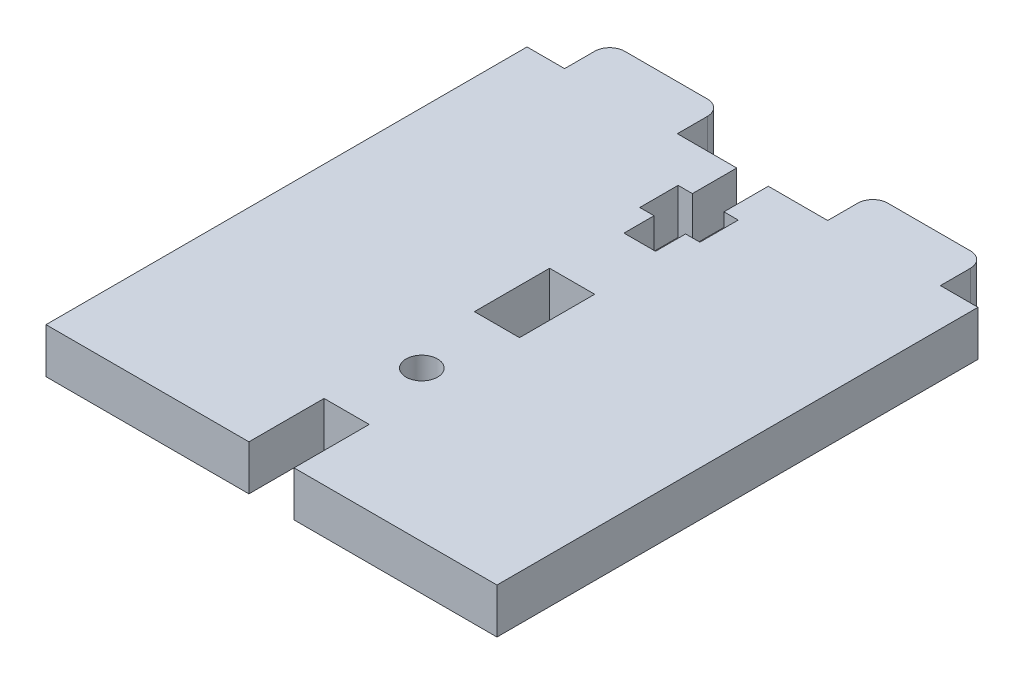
ISO-10303-21;
HEADER;
FILE_DESCRIPTION(('STEP AP214'),'2;1');
FILE_NAME('part.step','',(''),(''),'','','');
FILE_SCHEMA(('AUTOMOTIVE_DESIGN { 1 0 10303 214 1 1 1 1 }'));
ENDSEC;
DATA;
#1=APPLICATION_CONTEXT('core data for automotive mechanical design processes');
#2=APPLICATION_PROTOCOL_DEFINITION('international standard','automotive_design',2000,#1);
#3=PRODUCT_CONTEXT('',#1,'mechanical');
#4=PRODUCT('Part','Part','',(#3));
#5=PRODUCT_RELATED_PRODUCT_CATEGORY('part','',(#4));
#6=PRODUCT_DEFINITION_FORMATION('','',#4);
#7=PRODUCT_DEFINITION_CONTEXT('part definition',#1,'design');
#8=PRODUCT_DEFINITION('design','',#6,#7);
#9=PRODUCT_DEFINITION_SHAPE('','',#8);
#10=(LENGTH_UNIT() NAMED_UNIT(*) SI_UNIT(.MILLI.,.METRE.));
#11=(NAMED_UNIT(*) PLANE_ANGLE_UNIT() SI_UNIT($,.RADIAN.));
#12=(NAMED_UNIT(*) SI_UNIT($,.STERADIAN.) SOLID_ANGLE_UNIT());
#13=UNCERTAINTY_MEASURE_WITH_UNIT(LENGTH_MEASURE(1.E-05),#10,'distance_accuracy_value','');
#14=(GEOMETRIC_REPRESENTATION_CONTEXT(3) GLOBAL_UNCERTAINTY_ASSIGNED_CONTEXT((#13)) GLOBAL_UNIT_ASSIGNED_CONTEXT((#10,
#11,#12)) REPRESENTATION_CONTEXT('',''));
#15=CARTESIAN_POINT('',(0.,0.,0.));
#16=DIRECTION('',(0.,0.,1.));
#17=DIRECTION('',(1.,0.,0.));
#18=AXIS2_PLACEMENT_3D('',#15,#16,#17);
#19=CARTESIAN_POINT('',(0.,6.,24.));
#20=DIRECTION('',(0.,0.,-1.));
#21=DIRECTION('',(-1.,0.,0.));
#22=AXIS2_PLACEMENT_3D('',#19,#20,#21);
#23=PLANE('',#22);
#24=DIRECTION('',(1.,0.,0.));
#25=VECTOR('',#24,1.);
#26=CARTESIAN_POINT('',(0.,0.,24.));
#27=LINE('',#26,#25);
#28=CARTESIAN_POINT('',(27.,0.,24.));
#29=VERTEX_POINT('',#28);
#30=CARTESIAN_POINT('',(33.,0.,24.));
#31=VERTEX_POINT('',#30);
#32=EDGE_CURVE('E379',#29,#31,#27,.T.);
#33=ORIENTED_EDGE('',*,*,#32,.T.);
#34=DIRECTION('',(0.,-1.,0.));
#35=VECTOR('',#34,1.);
#36=CARTESIAN_POINT('',(33.,6.,24.));
#37=LINE('',#36,#35);
#38=CARTESIAN_POINT('',(33.,6.,24.));
#39=VERTEX_POINT('',#38);
#40=EDGE_CURVE('E11',#39,#31,#37,.T.);
#41=ORIENTED_EDGE('',*,*,#40,.F.);
#42=DIRECTION('',(1.,0.,0.));
#43=VECTOR('',#42,1.);
#44=CARTESIAN_POINT('',(0.,6.,24.));
#45=LINE('',#44,#43);
#46=CARTESIAN_POINT('',(27.,6.,24.));
#47=VERTEX_POINT('',#46);
#48=EDGE_CURVE('E284',#47,#39,#45,.T.);
#49=ORIENTED_EDGE('',*,*,#48,.F.);
#50=DIRECTION('',(0.,-1.,0.));
#51=VECTOR('',#50,1.);
#52=CARTESIAN_POINT('',(27.,6.,24.));
#53=LINE('',#52,#51);
#54=EDGE_CURVE('E56',#47,#29,#53,.T.);
#55=ORIENTED_EDGE('',*,*,#54,.T.);
#56=EDGE_LOOP('',(#33,#41,#49,#55));
#57=FACE_BOUND('',#56,.T.);
#58=ADVANCED_FACE('F37',(#57),#23,.F.);
#59=CARTESIAN_POINT('',(33.,6.,0.));
#60=DIRECTION('',(1.,0.,0.));
#61=DIRECTION('',(0.,0.,-1.));
#62=AXIS2_PLACEMENT_3D('',#59,#60,#61);
#63=PLANE('',#62);
#64=DIRECTION('',(0.,0.,1.));
#65=VECTOR('',#64,1.);
#66=CARTESIAN_POINT('',(33.,0.,0.));
#67=LINE('',#66,#65);
#68=CARTESIAN_POINT('',(33.,0.,34.));
#69=VERTEX_POINT('',#68);
#70=EDGE_CURVE('E290',#31,#69,#67,.T.);
#71=ORIENTED_EDGE('',*,*,#70,.T.);
#72=DIRECTION('',(0.,-1.,0.));
#73=VECTOR('',#72,1.);
#74=CARTESIAN_POINT('',(33.,6.,34.));
#75=LINE('',#74,#73);
#76=CARTESIAN_POINT('',(33.,6.,34.));
#77=VERTEX_POINT('',#76);
#78=EDGE_CURVE('E47',#77,#69,#75,.T.);
#79=ORIENTED_EDGE('',*,*,#78,.F.);
#80=DIRECTION('',(0.,0.,1.));
#81=VECTOR('',#80,1.);
#82=CARTESIAN_POINT('',(33.,6.,0.));
#83=LINE('',#82,#81);
#84=EDGE_CURVE('E278',#39,#77,#83,.T.);
#85=ORIENTED_EDGE('',*,*,#84,.F.);
#86=ORIENTED_EDGE('',*,*,#40,.T.);
#87=EDGE_LOOP('',(#71,#79,#85,#86));
#88=FACE_BOUND('',#87,.T.);
#89=ADVANCED_FACE('F289',(#88),#63,.F.);
#90=CARTESIAN_POINT('',(0.,6.,34.));
#91=DIRECTION('',(0.,0.,-1.));
#92=DIRECTION('',(-1.,0.,0.));
#93=AXIS2_PLACEMENT_3D('',#90,#91,#92);
#94=PLANE('',#93);
#95=DIRECTION('',(1.,0.,0.));
#96=VECTOR('',#95,1.);
#97=CARTESIAN_POINT('',(0.,0.,34.));
#98=LINE('',#97,#96);
#99=CARTESIAN_POINT('',(27.,0.,34.));
#100=VERTEX_POINT('',#99);
#101=EDGE_CURVE('E382',#100,#69,#98,.T.);
#102=ORIENTED_EDGE('',*,*,#101,.F.);
#103=DIRECTION('',(0.,-1.,0.));
#104=VECTOR('',#103,1.);
#105=CARTESIAN_POINT('',(27.,6.,34.));
#106=LINE('',#105,#104);
#107=CARTESIAN_POINT('',(27.,6.,34.));
#108=VERTEX_POINT('',#107);
#109=EDGE_CURVE('E166',#108,#100,#106,.T.);
#110=ORIENTED_EDGE('',*,*,#109,.F.);
#111=DIRECTION('',(1.,0.,0.));
#112=VECTOR('',#111,1.);
#113=CARTESIAN_POINT('',(0.,6.,34.));
#114=LINE('',#113,#112);
#115=EDGE_CURVE('E283',#108,#77,#114,.T.);
#116=ORIENTED_EDGE('',*,*,#115,.T.);
#117=ORIENTED_EDGE('',*,*,#78,.T.);
#118=EDGE_LOOP('',(#102,#110,#116,#117));
#119=FACE_BOUND('',#118,.T.);
#120=ADVANCED_FACE('F294',(#119),#94,.T.);
#121=CARTESIAN_POINT('',(7.,6.,-4.));
#122=DIRECTION('',(0.,-1.,0.));
#123=DIRECTION('',(0.,0.,-1.));
#124=AXIS2_PLACEMENT_3D('',#121,#122,#123);
#125=CYLINDRICAL_SURFACE('',#124,2.);
#126=CARTESIAN_POINT('',(7.,0.,-4.));
#127=DIRECTION('',(0.,1.,0.));
#128=DIRECTION('',(0.,0.,1.));
#129=AXIS2_PLACEMENT_3D('',#126,#127,#128);
#130=CIRCLE('',#129,2.);
#131=CARTESIAN_POINT('',(5.,0.,-3.99999999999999));
#132=VERTEX_POINT('',#131);
#133=CARTESIAN_POINT('',(7.00000000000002,0.,-6.));
#134=VERTEX_POINT('',#133);
#135=EDGE_CURVE('E301',#132,#134,#130,.F.);
#136=ORIENTED_EDGE('',*,*,#135,.F.);
#137=DIRECTION('',(0.,-1.,0.));
#138=VECTOR('',#137,1.);
#139=CARTESIAN_POINT('',(5.,6.,-3.99999999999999));
#140=LINE('',#139,#138);
#141=CARTESIAN_POINT('',(5.,6.,-3.99999999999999));
#142=VERTEX_POINT('',#141);
#143=EDGE_CURVE('E41',#142,#132,#140,.T.);
#144=ORIENTED_EDGE('',*,*,#143,.F.);
#145=CARTESIAN_POINT('',(7.,6.,-4.));
#146=DIRECTION('',(0.,1.,0.));
#147=DIRECTION('',(0.,0.,1.));
#148=AXIS2_PLACEMENT_3D('',#145,#146,#147);
#149=CIRCLE('',#148,2.);
#150=CARTESIAN_POINT('',(7.00000000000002,6.,-6.));
#151=VERTEX_POINT('',#150);
#152=EDGE_CURVE('E387',#142,#151,#149,.F.);
#153=ORIENTED_EDGE('',*,*,#152,.T.);
#154=DIRECTION('',(0.,-1.,0.));
#155=VECTOR('',#154,1.);
#156=CARTESIAN_POINT('',(7.00000000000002,6.,-6.));
#157=LINE('',#156,#155);
#158=EDGE_CURVE('E297',#151,#134,#157,.T.);
#159=ORIENTED_EDGE('',*,*,#158,.T.);
#160=EDGE_LOOP('',(#136,#144,#153,#159));
#161=FACE_BOUND('',#160,.T.);
#162=ADVANCED_FACE('F39',(#161),#125,.T.);
#163=CARTESIAN_POINT('',(5.,6.,0.));
#164=DIRECTION('',(-1.,0.,0.));
#165=DIRECTION('',(0.,0.,1.));
#166=AXIS2_PLACEMENT_3D('',#163,#164,#165);
#167=PLANE('',#166);
#168=DIRECTION('',(0.,0.,-1.));
#169=VECTOR('',#168,1.);
#170=CARTESIAN_POINT('',(5.,0.,0.));
#171=LINE('',#170,#169);
#172=CARTESIAN_POINT('',(5.,0.,0.));
#173=VERTEX_POINT('',#172);
#174=EDGE_CURVE('E304',#173,#132,#171,.T.);
#175=ORIENTED_EDGE('',*,*,#174,.F.);
#176=DIRECTION('',(0.,-1.,0.));
#177=VECTOR('',#176,1.);
#178=CARTESIAN_POINT('',(5.,6.,0.));
#179=LINE('',#178,#177);
#180=CARTESIAN_POINT('',(5.,6.,0.));
#181=VERTEX_POINT('',#180);
#182=EDGE_CURVE('E453',#181,#173,#179,.T.);
#183=ORIENTED_EDGE('',*,*,#182,.F.);
#184=DIRECTION('',(0.,0.,-1.));
#185=VECTOR('',#184,1.);
#186=CARTESIAN_POINT('',(5.,6.,0.));
#187=LINE('',#186,#185);
#188=EDGE_CURVE('E462',#181,#142,#187,.T.);
#189=ORIENTED_EDGE('',*,*,#188,.T.);
#190=ORIENTED_EDGE('',*,*,#143,.T.);
#191=EDGE_LOOP('',(#175,#183,#189,#190));
#192=FACE_BOUND('',#191,.T.);
#193=ADVANCED_FACE('F460',(#192),#167,.T.);
#194=CARTESIAN_POINT('',(0.,6.,0.));
#195=DIRECTION('',(0.,0.,-1.));
#196=DIRECTION('',(-1.,0.,0.));
#197=AXIS2_PLACEMENT_3D('',#194,#195,#196);
#198=PLANE('',#197);
#199=DIRECTION('',(1.,0.,0.));
#200=VECTOR('',#199,1.);
#201=CARTESIAN_POINT('',(0.,0.,0.));
#202=LINE('',#201,#200);
#203=CARTESIAN_POINT('',(0.,0.,0.));
#204=VERTEX_POINT('',#203);
#205=EDGE_CURVE('E307',#204,#173,#202,.T.);
#206=ORIENTED_EDGE('',*,*,#205,.F.);
#207=DIRECTION('',(0.,-1.,0.));
#208=VECTOR('',#207,1.);
#209=CARTESIAN_POINT('',(0.,6.,0.));
#210=LINE('',#209,#208);
#211=CARTESIAN_POINT('',(0.,6.,0.));
#212=VERTEX_POINT('',#211);
#213=EDGE_CURVE('E452',#212,#204,#210,.T.);
#214=ORIENTED_EDGE('',*,*,#213,.F.);
#215=DIRECTION('',(1.,0.,0.));
#216=VECTOR('',#215,1.);
#217=CARTESIAN_POINT('',(0.,6.,0.));
#218=LINE('',#217,#216);
#219=EDGE_CURVE('E472',#212,#181,#218,.T.);
#220=ORIENTED_EDGE('',*,*,#219,.T.);
#221=ORIENTED_EDGE('',*,*,#182,.T.);
#222=EDGE_LOOP('',(#206,#214,#220,#221));
#223=FACE_BOUND('',#222,.T.);
#224=ADVANCED_FACE('F469',(#223),#198,.T.);
#225=CARTESIAN_POINT('',(0.,6.,0.));
#226=DIRECTION('',(1.,0.,0.));
#227=DIRECTION('',(0.,0.,-1.));
#228=AXIS2_PLACEMENT_3D('',#225,#226,#227);
#229=PLANE('',#228);
#230=DIRECTION('',(0.,0.,1.));
#231=VECTOR('',#230,1.);
#232=CARTESIAN_POINT('',(0.,0.,0.));
#233=LINE('',#232,#231);
#234=CARTESIAN_POINT('',(0.,0.,64.));
#235=VERTEX_POINT('',#234);
#236=EDGE_CURVE('E310',#204,#235,#233,.T.);
#237=ORIENTED_EDGE('',*,*,#236,.T.);
#238=DIRECTION('',(0.,-1.,0.));
#239=VECTOR('',#238,1.);
#240=CARTESIAN_POINT('',(0.,6.,64.));
#241=LINE('',#240,#239);
#242=CARTESIAN_POINT('',(0.,6.,64.));
#243=VERTEX_POINT('',#242);
#244=EDGE_CURVE('E449',#243,#235,#241,.T.);
#245=ORIENTED_EDGE('',*,*,#244,.F.);
#246=DIRECTION('',(0.,0.,1.));
#247=VECTOR('',#246,1.);
#248=CARTESIAN_POINT('',(0.,6.,0.));
#249=LINE('',#248,#247);
#250=EDGE_CURVE('E475',#212,#243,#249,.T.);
#251=ORIENTED_EDGE('',*,*,#250,.F.);
#252=ORIENTED_EDGE('',*,*,#213,.T.);
#253=EDGE_LOOP('',(#237,#245,#251,#252));
#254=FACE_BOUND('',#253,.T.);
#255=ADVANCED_FACE('F476',(#254),#229,.F.);
#256=CARTESIAN_POINT('',(0.,6.,64.));
#257=DIRECTION('',(0.,0.,-1.));
#258=DIRECTION('',(-1.,0.,0.));
#259=AXIS2_PLACEMENT_3D('',#256,#257,#258);
#260=PLANE('',#259);
#261=DIRECTION('',(1.,0.,0.));
#262=VECTOR('',#261,1.);
#263=CARTESIAN_POINT('',(0.,0.,64.));
#264=LINE('',#263,#262);
#265=CARTESIAN_POINT('',(27.,0.,64.));
#266=VERTEX_POINT('',#265);
#267=EDGE_CURVE('E314',#235,#266,#264,.T.);
#268=ORIENTED_EDGE('',*,*,#267,.T.);
#269=DIRECTION('',(0.,-1.,0.));
#270=VECTOR('',#269,1.);
#271=CARTESIAN_POINT('',(27.,6.,64.));
#272=LINE('',#271,#270);
#273=CARTESIAN_POINT('',(27.,6.,64.));
#274=VERTEX_POINT('',#273);
#275=EDGE_CURVE('E447',#274,#266,#272,.T.);
#276=ORIENTED_EDGE('',*,*,#275,.F.);
#277=DIRECTION('',(1.,0.,0.));
#278=VECTOR('',#277,1.);
#279=CARTESIAN_POINT('',(0.,6.,64.));
#280=LINE('',#279,#278);
#281=EDGE_CURVE('E479',#243,#274,#280,.T.);
#282=ORIENTED_EDGE('',*,*,#281,.F.);
#283=ORIENTED_EDGE('',*,*,#244,.T.);
#284=EDGE_LOOP('',(#268,#276,#282,#283));
#285=FACE_BOUND('',#284,.T.);
#286=ADVANCED_FACE('F645',(#285),#260,.F.);
#287=CARTESIAN_POINT('',(27.,6.,0.));
#288=DIRECTION('',(1.,0.,0.));
#289=DIRECTION('',(0.,0.,-1.));
#290=AXIS2_PLACEMENT_3D('',#287,#288,#289);
#291=PLANE('',#290);
#292=DIRECTION('',(0.,0.,1.));
#293=VECTOR('',#292,1.);
#294=CARTESIAN_POINT('',(27.,0.,0.));
#295=LINE('',#294,#293);
#296=CARTESIAN_POINT('',(27.,0.,54.));
#297=VERTEX_POINT('',#296);
#298=EDGE_CURVE('E317',#297,#266,#295,.T.);
#299=ORIENTED_EDGE('',*,*,#298,.F.);
#300=DIRECTION('',(0.,-1.,0.));
#301=VECTOR('',#300,1.);
#302=CARTESIAN_POINT('',(27.,6.,54.));
#303=LINE('',#302,#301);
#304=CARTESIAN_POINT('',(27.,6.,54.));
#305=VERTEX_POINT('',#304);
#306=EDGE_CURVE('E445',#305,#297,#303,.T.);
#307=ORIENTED_EDGE('',*,*,#306,.F.);
#308=DIRECTION('',(0.,0.,1.));
#309=VECTOR('',#308,1.);
#310=CARTESIAN_POINT('',(27.,6.,0.));
#311=LINE('',#310,#309);
#312=EDGE_CURVE('E980',#305,#274,#311,.T.);
#313=ORIENTED_EDGE('',*,*,#312,.T.);
#314=ORIENTED_EDGE('',*,*,#275,.T.);
#315=EDGE_LOOP('',(#299,#307,#313,#314));
#316=FACE_BOUND('',#315,.T.);
#317=ADVANCED_FACE('F652',(#316),#291,.T.);
#318=CARTESIAN_POINT('',(0.,6.,54.));
#319=DIRECTION('',(0.,0.,-1.));
#320=DIRECTION('',(-1.,0.,0.));
#321=AXIS2_PLACEMENT_3D('',#318,#319,#320);
#322=PLANE('',#321);
#323=DIRECTION('',(1.,0.,0.));
#324=VECTOR('',#323,1.);
#325=CARTESIAN_POINT('',(0.,0.,54.));
#326=LINE('',#325,#324);
#327=CARTESIAN_POINT('',(33.,0.,54.));
#328=VERTEX_POINT('',#327);
#329=EDGE_CURVE('E321',#297,#328,#326,.T.);
#330=ORIENTED_EDGE('',*,*,#329,.T.);
#331=DIRECTION('',(0.,-1.,0.));
#332=VECTOR('',#331,1.);
#333=CARTESIAN_POINT('',(33.,6.,54.));
#334=LINE('',#333,#332);
#335=CARTESIAN_POINT('',(33.,6.,54.));
#336=VERTEX_POINT('',#335);
#337=EDGE_CURVE('E442',#336,#328,#334,.T.);
#338=ORIENTED_EDGE('',*,*,#337,.F.);
#339=DIRECTION('',(1.,0.,0.));
#340=VECTOR('',#339,1.);
#341=CARTESIAN_POINT('',(0.,6.,54.));
#342=LINE('',#341,#340);
#343=EDGE_CURVE('E977',#305,#336,#342,.T.);
#344=ORIENTED_EDGE('',*,*,#343,.F.);
#345=ORIENTED_EDGE('',*,*,#306,.T.);
#346=EDGE_LOOP('',(#330,#338,#344,#345));
#347=FACE_BOUND('',#346,.T.);
#348=ADVANCED_FACE('F648',(#347),#322,.F.);
#349=CARTESIAN_POINT('',(33.,6.,0.));
#350=DIRECTION('',(1.,0.,0.));
#351=DIRECTION('',(0.,0.,-1.));
#352=AXIS2_PLACEMENT_3D('',#349,#350,#351);
#353=PLANE('',#352);
#354=DIRECTION('',(0.,0.,1.));
#355=VECTOR('',#354,1.);
#356=CARTESIAN_POINT('',(33.,0.,0.));
#357=LINE('',#356,#355);
#358=CARTESIAN_POINT('',(33.,0.,64.));
#359=VERTEX_POINT('',#358);
#360=EDGE_CURVE('E323',#328,#359,#357,.T.);
#361=ORIENTED_EDGE('',*,*,#360,.T.);
#362=DIRECTION('',(0.,-1.,0.));
#363=VECTOR('',#362,1.);
#364=CARTESIAN_POINT('',(33.,6.,64.));
#365=LINE('',#364,#363);
#366=CARTESIAN_POINT('',(33.,6.,64.));
#367=VERTEX_POINT('',#366);
#368=EDGE_CURVE('E439',#367,#359,#365,.T.);
#369=ORIENTED_EDGE('',*,*,#368,.F.);
#370=DIRECTION('',(0.,0.,1.));
#371=VECTOR('',#370,1.);
#372=CARTESIAN_POINT('',(33.,6.,0.));
#373=LINE('',#372,#371);
#374=EDGE_CURVE('E975',#336,#367,#373,.T.);
#375=ORIENTED_EDGE('',*,*,#374,.F.);
#376=ORIENTED_EDGE('',*,*,#337,.T.);
#377=EDGE_LOOP('',(#361,#369,#375,#376));
#378=FACE_BOUND('',#377,.T.);
#379=ADVANCED_FACE('F643',(#378),#353,.F.);
#380=CARTESIAN_POINT('',(60.,0.,64.));
#381=VERTEX_POINT('',#380);
#382=EDGE_CURVE('E318',#359,#381,#264,.T.);
#383=ORIENTED_EDGE('',*,*,#382,.T.);
#384=DIRECTION('',(0.,-1.,0.));
#385=VECTOR('',#384,1.);
#386=CARTESIAN_POINT('',(60.,6.,64.));
#387=LINE('',#386,#385);
#388=CARTESIAN_POINT('',(60.,6.,64.));
#389=VERTEX_POINT('',#388);
#390=EDGE_CURVE('E437',#389,#381,#387,.T.);
#391=ORIENTED_EDGE('',*,*,#390,.F.);
#392=EDGE_CURVE('E498',#367,#389,#280,.T.);
#393=ORIENTED_EDGE('',*,*,#392,.F.);
#394=ORIENTED_EDGE('',*,*,#368,.T.);
#395=EDGE_LOOP('',(#383,#391,#393,#394));
#396=FACE_BOUND('',#395,.T.);
#397=ADVANCED_FACE('F639',(#396),#260,.F.);
#398=CARTESIAN_POINT('',(60.,6.,0.));
#399=DIRECTION('',(1.,0.,0.));
#400=DIRECTION('',(0.,0.,-1.));
#401=AXIS2_PLACEMENT_3D('',#398,#399,#400);
#402=PLANE('',#401);
#403=DIRECTION('',(0.,0.,1.));
#404=VECTOR('',#403,1.);
#405=CARTESIAN_POINT('',(60.,0.,0.));
#406=LINE('',#405,#404);
#407=CARTESIAN_POINT('',(60.,0.,0.));
#408=VERTEX_POINT('',#407);
#409=EDGE_CURVE('E325',#408,#381,#406,.T.);
#410=ORIENTED_EDGE('',*,*,#409,.F.);
#411=DIRECTION('',(0.,-1.,0.));
#412=VECTOR('',#411,1.);
#413=CARTESIAN_POINT('',(60.,6.,0.));
#414=LINE('',#413,#412);
#415=CARTESIAN_POINT('',(60.,6.,0.));
#416=VERTEX_POINT('',#415);
#417=EDGE_CURVE('E435',#416,#408,#414,.T.);
#418=ORIENTED_EDGE('',*,*,#417,.F.);
#419=DIRECTION('',(0.,0.,1.));
#420=VECTOR('',#419,1.);
#421=CARTESIAN_POINT('',(60.,6.,0.));
#422=LINE('',#421,#420);
#423=EDGE_CURVE('E492',#416,#389,#422,.T.);
#424=ORIENTED_EDGE('',*,*,#423,.T.);
#425=ORIENTED_EDGE('',*,*,#390,.T.);
#426=EDGE_LOOP('',(#410,#418,#424,#425));
#427=FACE_BOUND('',#426,.T.);
#428=ADVANCED_FACE('F636',(#427),#402,.T.);
#429=CARTESIAN_POINT('',(55.,0.,0.));
#430=VERTEX_POINT('',#429);
#431=EDGE_CURVE('E312',#430,#408,#202,.T.);
#432=ORIENTED_EDGE('',*,*,#431,.F.);
#433=DIRECTION('',(0.,-1.,0.));
#434=VECTOR('',#433,1.);
#435=CARTESIAN_POINT('',(55.,6.,0.));
#436=LINE('',#435,#434);
#437=CARTESIAN_POINT('',(55.,6.,0.));
#438=VERTEX_POINT('',#437);
#439=EDGE_CURVE('E433',#438,#430,#436,.T.);
#440=ORIENTED_EDGE('',*,*,#439,.F.);
#441=EDGE_CURVE('E484',#438,#416,#218,.T.);
#442=ORIENTED_EDGE('',*,*,#441,.T.);
#443=ORIENTED_EDGE('',*,*,#417,.T.);
#444=EDGE_LOOP('',(#432,#440,#442,#443));
#445=FACE_BOUND('',#444,.T.);
#446=ADVANCED_FACE('F634',(#445),#198,.T.);
#447=CARTESIAN_POINT('',(55.,6.,0.));
#448=DIRECTION('',(-1.,0.,0.));
#449=DIRECTION('',(0.,0.,1.));
#450=AXIS2_PLACEMENT_3D('',#447,#448,#449);
#451=PLANE('',#450);
#452=DIRECTION('',(0.,0.,-1.));
#453=VECTOR('',#452,1.);
#454=CARTESIAN_POINT('',(55.,0.,0.));
#455=LINE('',#454,#453);
#456=CARTESIAN_POINT('',(55.,0.,-3.99999999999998));
#457=VERTEX_POINT('',#456);
#458=EDGE_CURVE('E328',#430,#457,#455,.T.);
#459=ORIENTED_EDGE('',*,*,#458,.T.);
#460=DIRECTION('',(0.,-1.,0.));
#461=VECTOR('',#460,1.);
#462=CARTESIAN_POINT('',(55.,6.,-3.99999999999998));
#463=LINE('',#462,#461);
#464=CARTESIAN_POINT('',(55.,6.,-3.99999999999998));
#465=VERTEX_POINT('',#464);
#466=EDGE_CURVE('E431',#465,#457,#463,.T.);
#467=ORIENTED_EDGE('',*,*,#466,.F.);
#468=DIRECTION('',(0.,0.,-1.));
#469=VECTOR('',#468,1.);
#470=CARTESIAN_POINT('',(55.,6.,0.));
#471=LINE('',#470,#469);
#472=EDGE_CURVE('E491',#438,#465,#471,.T.);
#473=ORIENTED_EDGE('',*,*,#472,.F.);
#474=ORIENTED_EDGE('',*,*,#439,.T.);
#475=EDGE_LOOP('',(#459,#467,#473,#474));
#476=FACE_BOUND('',#475,.T.);
#477=ADVANCED_FACE('F630',(#476),#451,.F.);
#478=CARTESIAN_POINT('',(53.,6.,-4.));
#479=DIRECTION('',(0.,-1.,0.));
#480=DIRECTION('',(0.,0.,-1.));
#481=AXIS2_PLACEMENT_3D('',#478,#479,#480);
#482=CYLINDRICAL_SURFACE('',#481,2.);
#483=CARTESIAN_POINT('',(53.,0.,-4.));
#484=DIRECTION('',(0.,1.,0.));
#485=DIRECTION('',(0.,0.,1.));
#486=AXIS2_PLACEMENT_3D('',#483,#484,#485);
#487=CIRCLE('',#486,2.);
#488=CARTESIAN_POINT('',(53.,0.,-6.));
#489=VERTEX_POINT('',#488);
#490=EDGE_CURVE('E331',#489,#457,#487,.F.);
#491=ORIENTED_EDGE('',*,*,#490,.F.);
#492=DIRECTION('',(0.,-1.,0.));
#493=VECTOR('',#492,1.);
#494=CARTESIAN_POINT('',(53.,6.,-6.));
#495=LINE('',#494,#493);
#496=CARTESIAN_POINT('',(53.,6.,-6.));
#497=VERTEX_POINT('',#496);
#498=EDGE_CURVE('E429',#497,#489,#495,.T.);
#499=ORIENTED_EDGE('',*,*,#498,.F.);
#500=CARTESIAN_POINT('',(53.,6.,-4.));
#501=DIRECTION('',(0.,1.,0.));
#502=DIRECTION('',(0.,0.,1.));
#503=AXIS2_PLACEMENT_3D('',#500,#501,#502);
#504=CIRCLE('',#503,2.);
#505=EDGE_CURVE('E495',#497,#465,#504,.F.);
#506=ORIENTED_EDGE('',*,*,#505,.T.);
#507=ORIENTED_EDGE('',*,*,#466,.T.);
#508=EDGE_LOOP('',(#491,#499,#506,#507));
#509=FACE_BOUND('',#508,.T.);
#510=ADVANCED_FACE('F626',(#509),#482,.T.);
#511=CARTESIAN_POINT('',(0.,6.,-6.));
#512=DIRECTION('',(0.,0.,-1.));
#513=DIRECTION('',(-1.,0.,0.));
#514=AXIS2_PLACEMENT_3D('',#511,#512,#513);
#515=PLANE('',#514);
#516=DIRECTION('',(1.,0.,0.));
#517=VECTOR('',#516,1.);
#518=CARTESIAN_POINT('',(0.,0.,-6.));
#519=LINE('',#518,#517);
#520=CARTESIAN_POINT('',(42.,0.,-6.));
#521=VERTEX_POINT('',#520);
#522=EDGE_CURVE('E334',#521,#489,#519,.T.);
#523=ORIENTED_EDGE('',*,*,#522,.F.);
#524=DIRECTION('',(0.,-1.,0.));
#525=VECTOR('',#524,1.);
#526=CARTESIAN_POINT('',(42.,6.,-6.));
#527=LINE('',#526,#525);
#528=CARTESIAN_POINT('',(42.,6.,-6.));
#529=VERTEX_POINT('',#528);
#530=EDGE_CURVE('E427',#529,#521,#527,.T.);
#531=ORIENTED_EDGE('',*,*,#530,.F.);
#532=DIRECTION('',(1.,0.,0.));
#533=VECTOR('',#532,1.);
#534=CARTESIAN_POINT('',(0.,6.,-6.));
#535=LINE('',#534,#533);
#536=EDGE_CURVE('E514',#529,#497,#535,.T.);
#537=ORIENTED_EDGE('',*,*,#536,.T.);
#538=ORIENTED_EDGE('',*,*,#498,.T.);
#539=EDGE_LOOP('',(#523,#531,#537,#538));
#540=FACE_BOUND('',#539,.T.);
#541=ADVANCED_FACE('F622',(#540),#515,.T.);
#542=CARTESIAN_POINT('',(42.,6.,-4.));
#543=DIRECTION('',(0.,-1.,0.));
#544=DIRECTION('',(0.,0.,-1.));
#545=AXIS2_PLACEMENT_3D('',#542,#543,#544);
#546=CYLINDRICAL_SURFACE('',#545,2.);
#547=CARTESIAN_POINT('',(42.,0.,-4.));
#548=DIRECTION('',(0.,1.,0.));
#549=DIRECTION('',(0.,0.,1.));
#550=AXIS2_PLACEMENT_3D('',#547,#548,#549);
#551=CIRCLE('',#550,2.);
#552=CARTESIAN_POINT('',(40.,0.,-3.99999999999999));
#553=VERTEX_POINT('',#552);
#554=EDGE_CURVE('E337',#553,#521,#551,.F.);
#555=ORIENTED_EDGE('',*,*,#554,.F.);
#556=DIRECTION('',(0.,-1.,0.));
#557=VECTOR('',#556,1.);
#558=CARTESIAN_POINT('',(40.,6.,-3.99999999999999));
#559=LINE('',#558,#557);
#560=CARTESIAN_POINT('',(40.,6.,-3.99999999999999));
#561=VERTEX_POINT('',#560);
#562=EDGE_CURVE('E425',#561,#553,#559,.T.);
#563=ORIENTED_EDGE('',*,*,#562,.F.);
#564=CARTESIAN_POINT('',(42.,6.,-4.));
#565=DIRECTION('',(0.,1.,0.));
#566=DIRECTION('',(0.,0.,1.));
#567=AXIS2_PLACEMENT_3D('',#564,#565,#566);
#568=CIRCLE('',#567,2.);
#569=EDGE_CURVE('E509',#561,#529,#568,.F.);
#570=ORIENTED_EDGE('',*,*,#569,.T.);
#571=ORIENTED_EDGE('',*,*,#530,.T.);
#572=EDGE_LOOP('',(#555,#563,#570,#571));
#573=FACE_BOUND('',#572,.T.);
#574=ADVANCED_FACE('F619',(#573),#546,.T.);
#575=CARTESIAN_POINT('',(40.,6.,0.));
#576=DIRECTION('',(-1.,0.,0.));
#577=DIRECTION('',(0.,0.,1.));
#578=AXIS2_PLACEMENT_3D('',#575,#576,#577);
#579=PLANE('',#578);
#580=DIRECTION('',(0.,0.,-1.));
#581=VECTOR('',#580,1.);
#582=CARTESIAN_POINT('',(40.,0.,0.));
#583=LINE('',#582,#581);
#584=CARTESIAN_POINT('',(40.,0.,0.));
#585=VERTEX_POINT('',#584);
#586=EDGE_CURVE('E340',#585,#553,#583,.T.);
#587=ORIENTED_EDGE('',*,*,#586,.F.);
#588=DIRECTION('',(0.,-1.,0.));
#589=VECTOR('',#588,1.);
#590=CARTESIAN_POINT('',(40.,6.,0.));
#591=LINE('',#590,#589);
#592=CARTESIAN_POINT('',(40.,6.,0.));
#593=VERTEX_POINT('',#592);
#594=EDGE_CURVE('E423',#593,#585,#591,.T.);
#595=ORIENTED_EDGE('',*,*,#594,.F.);
#596=DIRECTION('',(0.,0.,-1.));
#597=VECTOR('',#596,1.);
#598=CARTESIAN_POINT('',(40.,6.,0.));
#599=LINE('',#598,#597);
#600=EDGE_CURVE('E502',#593,#561,#599,.T.);
#601=ORIENTED_EDGE('',*,*,#600,.T.);
#602=ORIENTED_EDGE('',*,*,#562,.T.);
#603=EDGE_LOOP('',(#587,#595,#601,#602));
#604=FACE_BOUND('',#603,.T.);
#605=ADVANCED_FACE('F616',(#604),#579,.T.);
#606=CARTESIAN_POINT('',(32.1,0.,0.));
#607=VERTEX_POINT('',#606);
#608=EDGE_CURVE('E343',#607,#585,#202,.T.);
#609=ORIENTED_EDGE('',*,*,#608,.F.);
#610=DIRECTION('',(0.,-1.,0.));
#611=VECTOR('',#610,1.);
#612=CARTESIAN_POINT('',(32.1,6.,0.));
#613=LINE('',#612,#611);
#614=CARTESIAN_POINT('',(32.1,6.,0.));
#615=VERTEX_POINT('',#614);
#616=EDGE_CURVE('E421',#615,#607,#613,.T.);
#617=ORIENTED_EDGE('',*,*,#616,.F.);
#618=EDGE_CURVE('E489',#615,#593,#218,.T.);
#619=ORIENTED_EDGE('',*,*,#618,.T.);
#620=ORIENTED_EDGE('',*,*,#594,.T.);
#621=EDGE_LOOP('',(#609,#617,#619,#620));
#622=FACE_BOUND('',#621,.T.);
#623=ADVANCED_FACE('F584',(#622),#198,.T.);
#624=CARTESIAN_POINT('',(32.1,6.,0.));
#625=DIRECTION('',(1.,0.,0.));
#626=DIRECTION('',(0.,0.,-1.));
#627=AXIS2_PLACEMENT_3D('',#624,#625,#626);
#628=PLANE('',#627);
#629=DIRECTION('',(0.,0.,1.));
#630=VECTOR('',#629,1.);
#631=CARTESIAN_POINT('',(32.1,0.,0.));
#632=LINE('',#631,#630);
#633=CARTESIAN_POINT('',(32.1,0.,5.9));
#634=VERTEX_POINT('',#633);
#635=EDGE_CURVE('E344',#607,#634,#632,.T.);
#636=ORIENTED_EDGE('',*,*,#635,.T.);
#637=DIRECTION('',(0.,-1.,0.));
#638=VECTOR('',#637,1.);
#639=CARTESIAN_POINT('',(32.1,6.,5.9));
#640=LINE('',#639,#638);
#641=CARTESIAN_POINT('',(32.1,6.,5.9));
#642=VERTEX_POINT('',#641);
#643=EDGE_CURVE('E418',#642,#634,#640,.T.);
#644=ORIENTED_EDGE('',*,*,#643,.F.);
#645=DIRECTION('',(0.,0.,1.));
#646=VECTOR('',#645,1.);
#647=CARTESIAN_POINT('',(32.1,6.,0.));
#648=LINE('',#647,#646);
#649=EDGE_CURVE('E501',#615,#642,#648,.T.);
#650=ORIENTED_EDGE('',*,*,#649,.F.);
#651=ORIENTED_EDGE('',*,*,#616,.T.);
#652=EDGE_LOOP('',(#636,#644,#650,#651));
#653=FACE_BOUND('',#652,.T.);
#654=ADVANCED_FACE('F611',(#653),#628,.F.);
#655=CARTESIAN_POINT('',(0.,6.,5.9));
#656=DIRECTION('',(0.,0.,-1.));
#657=DIRECTION('',(-1.,0.,0.));
#658=AXIS2_PLACEMENT_3D('',#655,#656,#657);
#659=PLANE('',#658);
#660=DIRECTION('',(1.,0.,0.));
#661=VECTOR('',#660,1.);
#662=CARTESIAN_POINT('',(0.,0.,5.9));
#663=LINE('',#662,#661);
#664=CARTESIAN_POINT('',(34.,0.,5.9));
#665=VERTEX_POINT('',#664);
#666=EDGE_CURVE('E346',#634,#665,#663,.T.);
#667=ORIENTED_EDGE('',*,*,#666,.T.);
#668=DIRECTION('',(0.,-1.,0.));
#669=VECTOR('',#668,1.);
#670=CARTESIAN_POINT('',(34.,6.,5.9));
#671=LINE('',#670,#669);
#672=CARTESIAN_POINT('',(34.,6.,5.9));
#673=VERTEX_POINT('',#672);
#674=EDGE_CURVE('E415',#673,#665,#671,.T.);
#675=ORIENTED_EDGE('',*,*,#674,.F.);
#676=DIRECTION('',(1.,0.,0.));
#677=VECTOR('',#676,1.);
#678=CARTESIAN_POINT('',(0.,6.,5.9));
#679=LINE('',#678,#677);
#680=EDGE_CURVE('E505',#642,#673,#679,.T.);
#681=ORIENTED_EDGE('',*,*,#680,.F.);
#682=ORIENTED_EDGE('',*,*,#643,.T.);
#683=EDGE_LOOP('',(#667,#675,#681,#682));
#684=FACE_BOUND('',#683,.T.);
#685=ADVANCED_FACE('F594',(#684),#659,.F.);
#686=CARTESIAN_POINT('',(34.,6.,0.));
#687=DIRECTION('',(1.,0.,0.));
#688=DIRECTION('',(0.,0.,-1.));
#689=AXIS2_PLACEMENT_3D('',#686,#687,#688);
#690=PLANE('',#689);
#691=DIRECTION('',(0.,0.,1.));
#692=VECTOR('',#691,1.);
#693=CARTESIAN_POINT('',(34.,0.,0.));
#694=LINE('',#693,#692);
#695=CARTESIAN_POINT('',(34.,0.,11.));
#696=VERTEX_POINT('',#695);
#697=EDGE_CURVE('E349',#665,#696,#694,.T.);
#698=ORIENTED_EDGE('',*,*,#697,.T.);
#699=DIRECTION('',(0.,-1.,0.));
#700=VECTOR('',#699,1.);
#701=CARTESIAN_POINT('',(34.,6.,11.));
#702=LINE('',#701,#700);
#703=CARTESIAN_POINT('',(34.,6.,11.));
#704=VERTEX_POINT('',#703);
#705=EDGE_CURVE('E413',#704,#696,#702,.T.);
#706=ORIENTED_EDGE('',*,*,#705,.F.);
#707=DIRECTION('',(0.,0.,1.));
#708=VECTOR('',#707,1.);
#709=CARTESIAN_POINT('',(34.,6.,0.));
#710=LINE('',#709,#708);
#711=EDGE_CURVE('E519',#673,#704,#710,.T.);
#712=ORIENTED_EDGE('',*,*,#711,.F.);
#713=ORIENTED_EDGE('',*,*,#674,.T.);
#714=EDGE_LOOP('',(#698,#706,#712,#713));
#715=FACE_BOUND('',#714,.T.);
#716=ADVANCED_FACE('F612',(#715),#690,.F.);
#717=CARTESIAN_POINT('',(0.,6.,11.));
#718=DIRECTION('',(0.,0.,-1.));
#719=DIRECTION('',(-1.,0.,0.));
#720=AXIS2_PLACEMENT_3D('',#717,#718,#719);
#721=PLANE('',#720);
#722=DIRECTION('',(1.,0.,0.));
#723=VECTOR('',#722,1.);
#724=CARTESIAN_POINT('',(0.,0.,11.));
#725=LINE('',#724,#723);
#726=CARTESIAN_POINT('',(32.1,0.,11.));
#727=VERTEX_POINT('',#726);
#728=EDGE_CURVE('E353',#727,#696,#725,.T.);
#729=ORIENTED_EDGE('',*,*,#728,.F.);
#730=DIRECTION('',(0.,-1.,0.));
#731=VECTOR('',#730,1.);
#732=CARTESIAN_POINT('',(32.1,6.,11.));
#733=LINE('',#732,#731);
#734=CARTESIAN_POINT('',(32.1,6.,11.));
#735=VERTEX_POINT('',#734);
#736=EDGE_CURVE('E411',#735,#727,#733,.T.);
#737=ORIENTED_EDGE('',*,*,#736,.F.);
#738=DIRECTION('',(1.,0.,0.));
#739=VECTOR('',#738,1.);
#740=CARTESIAN_POINT('',(0.,6.,11.));
#741=LINE('',#740,#739);
#742=EDGE_CURVE('E522',#735,#704,#741,.T.);
#743=ORIENTED_EDGE('',*,*,#742,.T.);
#744=ORIENTED_EDGE('',*,*,#705,.T.);
#745=EDGE_LOOP('',(#729,#737,#743,#744));
#746=FACE_BOUND('',#745,.T.);
#747=ADVANCED_FACE('F602',(#746),#721,.T.);
#748=CARTESIAN_POINT('',(32.1,0.,15.));
#749=VERTEX_POINT('',#748);
#750=EDGE_CURVE('E347',#727,#749,#632,.T.);
#751=ORIENTED_EDGE('',*,*,#750,.T.);
#752=DIRECTION('',(0.,-1.,0.));
#753=VECTOR('',#752,1.);
#754=CARTESIAN_POINT('',(32.1,6.,15.));
#755=LINE('',#754,#753);
#756=CARTESIAN_POINT('',(32.1,6.,15.));
#757=VERTEX_POINT('',#756);
#758=EDGE_CURVE('E409',#757,#749,#755,.T.);
#759=ORIENTED_EDGE('',*,*,#758,.F.);
#760=EDGE_CURVE('E507',#735,#757,#648,.T.);
#761=ORIENTED_EDGE('',*,*,#760,.F.);
#762=ORIENTED_EDGE('',*,*,#736,.T.);
#763=EDGE_LOOP('',(#751,#759,#761,#762));
#764=FACE_BOUND('',#763,.T.);
#765=ADVANCED_FACE('F606',(#764),#628,.F.);
#766=CARTESIAN_POINT('',(0.,6.,15.));
#767=DIRECTION('',(0.,0.,-1.));
#768=DIRECTION('',(-1.,0.,0.));
#769=AXIS2_PLACEMENT_3D('',#766,#767,#768);
#770=PLANE('',#769);
#771=DIRECTION('',(1.,0.,0.));
#772=VECTOR('',#771,1.);
#773=CARTESIAN_POINT('',(0.,0.,15.));
#774=LINE('',#773,#772);
#775=CARTESIAN_POINT('',(27.9,0.,15.));
#776=VERTEX_POINT('',#775);
#777=EDGE_CURVE('E357',#776,#749,#774,.T.);
#778=ORIENTED_EDGE('',*,*,#777,.F.);
#779=DIRECTION('',(0.,-1.,0.));
#780=VECTOR('',#779,1.);
#781=CARTESIAN_POINT('',(27.9,6.,15.));
#782=LINE('',#781,#780);
#783=CARTESIAN_POINT('',(27.9,6.,15.));
#784=VERTEX_POINT('',#783);
#785=EDGE_CURVE('E407',#784,#776,#782,.T.);
#786=ORIENTED_EDGE('',*,*,#785,.F.);
#787=DIRECTION('',(1.,0.,0.));
#788=VECTOR('',#787,1.);
#789=CARTESIAN_POINT('',(0.,6.,15.));
#790=LINE('',#789,#788);
#791=EDGE_CURVE('E526',#784,#757,#790,.T.);
#792=ORIENTED_EDGE('',*,*,#791,.T.);
#793=ORIENTED_EDGE('',*,*,#758,.T.);
#794=EDGE_LOOP('',(#778,#786,#792,#793));
#795=FACE_BOUND('',#794,.T.);
#796=ADVANCED_FACE('F603',(#795),#770,.T.);
#797=CARTESIAN_POINT('',(27.9,6.,0.));
#798=DIRECTION('',(1.,0.,0.));
#799=DIRECTION('',(0.,0.,-1.));
#800=AXIS2_PLACEMENT_3D('',#797,#798,#799);
#801=PLANE('',#800);
#802=DIRECTION('',(0.,0.,1.));
#803=VECTOR('',#802,1.);
#804=CARTESIAN_POINT('',(27.9,0.,0.));
#805=LINE('',#804,#803);
#806=CARTESIAN_POINT('',(27.9,0.,11.));
#807=VERTEX_POINT('',#806);
#808=EDGE_CURVE('E360',#807,#776,#805,.T.);
#809=ORIENTED_EDGE('',*,*,#808,.F.);
#810=DIRECTION('',(0.,-1.,0.));
#811=VECTOR('',#810,1.);
#812=CARTESIAN_POINT('',(27.9,6.,11.));
#813=LINE('',#812,#811);
#814=CARTESIAN_POINT('',(27.9,6.,11.));
#815=VERTEX_POINT('',#814);
#816=EDGE_CURVE('E405',#815,#807,#813,.T.);
#817=ORIENTED_EDGE('',*,*,#816,.F.);
#818=DIRECTION('',(0.,0.,1.));
#819=VECTOR('',#818,1.);
#820=CARTESIAN_POINT('',(27.9,6.,0.));
#821=LINE('',#820,#819);
#822=EDGE_CURVE('E529',#815,#784,#821,.T.);
#823=ORIENTED_EDGE('',*,*,#822,.T.);
#824=ORIENTED_EDGE('',*,*,#785,.T.);
#825=EDGE_LOOP('',(#809,#817,#823,#824));
#826=FACE_BOUND('',#825,.T.);
#827=ADVANCED_FACE('F589',(#826),#801,.T.);
#828=CARTESIAN_POINT('',(26.,0.,11.));
#829=VERTEX_POINT('',#828);
#830=EDGE_CURVE('E356',#829,#807,#725,.T.);
#831=ORIENTED_EDGE('',*,*,#830,.F.);
#832=DIRECTION('',(0.,-1.,0.));
#833=VECTOR('',#832,1.);
#834=CARTESIAN_POINT('',(26.,6.,11.));
#835=LINE('',#834,#833);
#836=CARTESIAN_POINT('',(26.,6.,11.));
#837=VERTEX_POINT('',#836);
#838=EDGE_CURVE('E403',#837,#829,#835,.T.);
#839=ORIENTED_EDGE('',*,*,#838,.F.);
#840=EDGE_CURVE('E525',#837,#815,#741,.T.);
#841=ORIENTED_EDGE('',*,*,#840,.T.);
#842=ORIENTED_EDGE('',*,*,#816,.T.);
#843=EDGE_LOOP('',(#831,#839,#841,#842));
#844=FACE_BOUND('',#843,.T.);
#845=ADVANCED_FACE('F597',(#844),#721,.T.);
#846=CARTESIAN_POINT('',(26.,6.,0.));
#847=DIRECTION('',(1.,0.,0.));
#848=DIRECTION('',(0.,0.,-1.));
#849=AXIS2_PLACEMENT_3D('',#846,#847,#848);
#850=PLANE('',#849);
#851=DIRECTION('',(0.,0.,1.));
#852=VECTOR('',#851,1.);
#853=CARTESIAN_POINT('',(26.,0.,0.));
#854=LINE('',#853,#852);
#855=CARTESIAN_POINT('',(26.,0.,5.9));
#856=VERTEX_POINT('',#855);
#857=EDGE_CURVE('E364',#856,#829,#854,.T.);
#858=ORIENTED_EDGE('',*,*,#857,.F.);
#859=DIRECTION('',(0.,-1.,0.));
#860=VECTOR('',#859,1.);
#861=CARTESIAN_POINT('',(26.,6.,5.9));
#862=LINE('',#861,#860);
#863=CARTESIAN_POINT('',(26.,6.,5.9));
#864=VERTEX_POINT('',#863);
#865=EDGE_CURVE('E401',#864,#856,#862,.T.);
#866=ORIENTED_EDGE('',*,*,#865,.F.);
#867=DIRECTION('',(0.,0.,1.));
#868=VECTOR('',#867,1.);
#869=CARTESIAN_POINT('',(26.,6.,0.));
#870=LINE('',#869,#868);
#871=EDGE_CURVE('E532',#864,#837,#870,.T.);
#872=ORIENTED_EDGE('',*,*,#871,.T.);
#873=ORIENTED_EDGE('',*,*,#838,.T.);
#874=EDGE_LOOP('',(#858,#866,#872,#873));
#875=FACE_BOUND('',#874,.T.);
#876=ADVANCED_FACE('F592',(#875),#850,.T.);
#877=CARTESIAN_POINT('',(27.9,0.,5.9));
#878=VERTEX_POINT('',#877);
#879=EDGE_CURVE('E350',#856,#878,#663,.T.);
#880=ORIENTED_EDGE('',*,*,#879,.T.);
#881=DIRECTION('',(0.,-1.,0.));
#882=VECTOR('',#881,1.);
#883=CARTESIAN_POINT('',(27.9,6.,5.9));
#884=LINE('',#883,#882);
#885=CARTESIAN_POINT('',(27.9,6.,5.9));
#886=VERTEX_POINT('',#885);
#887=EDGE_CURVE('E399',#886,#878,#884,.T.);
#888=ORIENTED_EDGE('',*,*,#887,.F.);
#889=EDGE_CURVE('E520',#864,#886,#679,.T.);
#890=ORIENTED_EDGE('',*,*,#889,.F.);
#891=ORIENTED_EDGE('',*,*,#865,.T.);
#892=EDGE_LOOP('',(#880,#888,#890,#891));
#893=FACE_BOUND('',#892,.T.);
#894=ADVANCED_FACE('F587',(#893),#659,.F.);
#895=CARTESIAN_POINT('',(27.9,0.,0.));
#896=VERTEX_POINT('',#895);
#897=EDGE_CURVE('E363',#896,#878,#805,.T.);
#898=ORIENTED_EDGE('',*,*,#897,.F.);
#899=DIRECTION('',(0.,-1.,0.));
#900=VECTOR('',#899,1.);
#901=CARTESIAN_POINT('',(27.9,6.,0.));
#902=LINE('',#901,#900);
#903=CARTESIAN_POINT('',(27.9,6.,0.));
#904=VERTEX_POINT('',#903);
#905=EDGE_CURVE('E397',#904,#896,#902,.T.);
#906=ORIENTED_EDGE('',*,*,#905,.F.);
#907=EDGE_CURVE('E488',#904,#886,#821,.T.);
#908=ORIENTED_EDGE('',*,*,#907,.T.);
#909=ORIENTED_EDGE('',*,*,#887,.T.);
#910=EDGE_LOOP('',(#898,#906,#908,#909));
#911=FACE_BOUND('',#910,.T.);
#912=ADVANCED_FACE('F582',(#911),#801,.T.);
#913=CARTESIAN_POINT('',(20.,0.,0.));
#914=VERTEX_POINT('',#913);
#915=EDGE_CURVE('E311',#914,#896,#202,.T.);
#916=ORIENTED_EDGE('',*,*,#915,.F.);
#917=DIRECTION('',(0.,-1.,0.));
#918=VECTOR('',#917,1.);
#919=CARTESIAN_POINT('',(20.,6.,0.));
#920=LINE('',#919,#918);
#921=CARTESIAN_POINT('',(20.,6.,0.));
#922=VERTEX_POINT('',#921);
#923=EDGE_CURVE('E395',#922,#914,#920,.T.);
#924=ORIENTED_EDGE('',*,*,#923,.F.);
#925=EDGE_CURVE('E483',#922,#904,#218,.T.);
#926=ORIENTED_EDGE('',*,*,#925,.T.);
#927=ORIENTED_EDGE('',*,*,#905,.T.);
#928=EDGE_LOOP('',(#916,#924,#926,#927));
#929=FACE_BOUND('',#928,.T.);
#930=ADVANCED_FACE('F578',(#929),#198,.T.);
#931=CARTESIAN_POINT('',(20.,6.,0.));
#932=DIRECTION('',(-1.,0.,0.));
#933=DIRECTION('',(0.,0.,1.));
#934=AXIS2_PLACEMENT_3D('',#931,#932,#933);
#935=PLANE('',#934);
#936=DIRECTION('',(0.,0.,-1.));
#937=VECTOR('',#936,1.);
#938=CARTESIAN_POINT('',(20.,0.,0.));
#939=LINE('',#938,#937);
#940=CARTESIAN_POINT('',(20.,0.,-3.99999999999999));
#941=VERTEX_POINT('',#940);
#942=EDGE_CURVE('E367',#914,#941,#939,.T.);
#943=ORIENTED_EDGE('',*,*,#942,.T.);
#944=DIRECTION('',(0.,-1.,0.));
#945=VECTOR('',#944,1.);
#946=CARTESIAN_POINT('',(20.,6.,-3.99999999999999));
#947=LINE('',#946,#945);
#948=CARTESIAN_POINT('',(20.,6.,-3.99999999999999));
#949=VERTEX_POINT('',#948);
#950=EDGE_CURVE('E393',#949,#941,#947,.T.);
#951=ORIENTED_EDGE('',*,*,#950,.F.);
#952=DIRECTION('',(0.,0.,-1.));
#953=VECTOR('',#952,1.);
#954=CARTESIAN_POINT('',(20.,6.,0.));
#955=LINE('',#954,#953);
#956=EDGE_CURVE('E487',#922,#949,#955,.T.);
#957=ORIENTED_EDGE('',*,*,#956,.F.);
#958=ORIENTED_EDGE('',*,*,#923,.T.);
#959=EDGE_LOOP('',(#943,#951,#957,#958));
#960=FACE_BOUND('',#959,.T.);
#961=ADVANCED_FACE('F574',(#960),#935,.F.);
#962=CARTESIAN_POINT('',(18.,6.,-4.));
#963=DIRECTION('',(0.,-1.,0.));
#964=DIRECTION('',(0.,0.,-1.));
#965=AXIS2_PLACEMENT_3D('',#962,#963,#964);
#966=CYLINDRICAL_SURFACE('',#965,2.);
#967=CARTESIAN_POINT('',(18.,0.,-4.));
#968=DIRECTION('',(0.,1.,0.));
#969=DIRECTION('',(0.,0.,1.));
#970=AXIS2_PLACEMENT_3D('',#967,#968,#969);
#971=CIRCLE('',#970,2.);
#972=CARTESIAN_POINT('',(18.,0.,-6.));
#973=VERTEX_POINT('',#972);
#974=EDGE_CURVE('E370',#973,#941,#971,.F.);
#975=ORIENTED_EDGE('',*,*,#974,.F.);
#976=DIRECTION('',(0.,-1.,0.));
#977=VECTOR('',#976,1.);
#978=CARTESIAN_POINT('',(18.,6.,-6.));
#979=LINE('',#978,#977);
#980=CARTESIAN_POINT('',(18.,6.,-6.));
#981=VERTEX_POINT('',#980);
#982=EDGE_CURVE('E391',#981,#973,#979,.T.);
#983=ORIENTED_EDGE('',*,*,#982,.F.);
#984=CARTESIAN_POINT('',(18.,6.,-4.));
#985=DIRECTION('',(0.,1.,0.));
#986=DIRECTION('',(0.,0.,1.));
#987=AXIS2_PLACEMENT_3D('',#984,#985,#986);
#988=CIRCLE('',#987,2.);
#989=EDGE_CURVE('E536',#981,#949,#988,.F.);
#990=ORIENTED_EDGE('',*,*,#989,.T.);
#991=ORIENTED_EDGE('',*,*,#950,.T.);
#992=EDGE_LOOP('',(#975,#983,#990,#991));
#993=FACE_BOUND('',#992,.T.);
#994=ADVANCED_FACE('F568',(#993),#966,.T.);
#995=CARTESIAN_POINT('',(30.,6.,44.));
#996=DIRECTION('',(0.,-1.,0.));
#997=DIRECTION('',(0.,0.,-1.));
#998=AXIS2_PLACEMENT_3D('',#995,#996,#997);
#999=CYLINDRICAL_SURFACE('',#998,2.1);
#1000=CARTESIAN_POINT('',(30.,6.,44.));
#1001=DIRECTION('',(0.,1.,0.));
#1002=DIRECTION('',(0.,0.,1.));
#1003=AXIS2_PLACEMENT_3D('',#1000,#1001,#1002);
#1004=CIRCLE('',#1003,2.1);
#1005=CARTESIAN_POINT('',(30.,6.,46.1));
#1006=VERTEX_POINT('',#1005);
#1007=EDGE_CURVE('E542',#1006,#1006,#1004,.T.);
#1008=ORIENTED_EDGE('',*,*,#1007,.T.);
#1009=EDGE_LOOP('',(#1008));
#1010=FACE_BOUND('',#1009,.T.);
#1011=CARTESIAN_POINT('',(30.,0.,44.));
#1012=DIRECTION('',(0.,1.,0.));
#1013=DIRECTION('',(0.,0.,1.));
#1014=AXIS2_PLACEMENT_3D('',#1011,#1012,#1013);
#1015=CIRCLE('',#1014,2.1);
#1016=CARTESIAN_POINT('',(30.,0.,46.1));
#1017=VERTEX_POINT('',#1016);
#1018=EDGE_CURVE('E376',#1017,#1017,#1015,.T.);
#1019=ORIENTED_EDGE('',*,*,#1018,.F.);
#1020=EDGE_LOOP('',(#1019));
#1021=FACE_BOUND('',#1020,.T.);
#1022=ADVANCED_FACE('F546',(#1010,#1021),#999,.F.);
#1023=CARTESIAN_POINT('',(0.,6.,-6.));
#1024=DIRECTION('',(0.,0.,-1.));
#1025=DIRECTION('',(-1.,0.,0.));
#1026=AXIS2_PLACEMENT_3D('',#1023,#1024,#1025);
#1027=PLANE('',#1026);
#1028=DIRECTION('',(1.,0.,0.));
#1029=VECTOR('',#1028,1.);
#1030=CARTESIAN_POINT('',(0.,0.,-6.));
#1031=LINE('',#1030,#1029);
#1032=EDGE_CURVE('E373',#134,#973,#1031,.T.);
#1033=ORIENTED_EDGE('',*,*,#1032,.F.);
#1034=ORIENTED_EDGE('',*,*,#158,.F.);
#1035=DIRECTION('',(1.,0.,0.));
#1036=VECTOR('',#1035,1.);
#1037=CARTESIAN_POINT('',(0.,6.,-6.));
#1038=LINE('',#1037,#1036);
#1039=EDGE_CURVE('E539',#151,#981,#1038,.T.);
#1040=ORIENTED_EDGE('',*,*,#1039,.T.);
#1041=ORIENTED_EDGE('',*,*,#982,.T.);
#1042=EDGE_LOOP('',(#1033,#1034,#1040,#1041));
#1043=FACE_BOUND('',#1042,.T.);
#1044=ADVANCED_FACE('F556',(#1043),#1027,.T.);
#1045=CARTESIAN_POINT('',(27.,6.,0.));
#1046=DIRECTION('',(1.,0.,0.));
#1047=DIRECTION('',(0.,0.,-1.));
#1048=AXIS2_PLACEMENT_3D('',#1045,#1046,#1047);
#1049=PLANE('',#1048);
#1050=DIRECTION('',(0.,0.,1.));
#1051=VECTOR('',#1050,1.);
#1052=CARTESIAN_POINT('',(27.,0.,0.));
#1053=LINE('',#1052,#1051);
#1054=EDGE_CURVE('E384',#29,#100,#1053,.T.);
#1055=ORIENTED_EDGE('',*,*,#1054,.F.);
#1056=ORIENTED_EDGE('',*,*,#54,.F.);
#1057=DIRECTION('',(0.,0.,1.));
#1058=VECTOR('',#1057,1.);
#1059=CARTESIAN_POINT('',(27.,6.,0.));
#1060=LINE('',#1059,#1058);
#1061=EDGE_CURVE('E295',#47,#108,#1060,.T.);
#1062=ORIENTED_EDGE('',*,*,#1061,.T.);
#1063=ORIENTED_EDGE('',*,*,#109,.T.);
#1064=EDGE_LOOP('',(#1055,#1056,#1062,#1063));
#1065=FACE_BOUND('',#1064,.T.);
#1066=ADVANCED_FACE('F549',(#1065),#1049,.T.);
#1067=CARTESIAN_POINT('',(0.,6.,0.));
#1068=DIRECTION('',(0.,1.,0.));
#1069=DIRECTION('',(0.,0.,1.));
#1070=AXIS2_PLACEMENT_3D('',#1067,#1068,#1069);
#1071=PLANE('',#1070);
#1072=ORIENTED_EDGE('',*,*,#152,.F.);
#1073=ORIENTED_EDGE('',*,*,#188,.F.);
#1074=ORIENTED_EDGE('',*,*,#219,.F.);
#1075=ORIENTED_EDGE('',*,*,#250,.T.);
#1076=ORIENTED_EDGE('',*,*,#281,.T.);
#1077=ORIENTED_EDGE('',*,*,#312,.F.);
#1078=ORIENTED_EDGE('',*,*,#343,.T.);
#1079=ORIENTED_EDGE('',*,*,#374,.T.);
#1080=ORIENTED_EDGE('',*,*,#392,.T.);
#1081=ORIENTED_EDGE('',*,*,#423,.F.);
#1082=ORIENTED_EDGE('',*,*,#441,.F.);
#1083=ORIENTED_EDGE('',*,*,#472,.T.);
#1084=ORIENTED_EDGE('',*,*,#505,.F.);
#1085=ORIENTED_EDGE('',*,*,#536,.F.);
#1086=ORIENTED_EDGE('',*,*,#569,.F.);
#1087=ORIENTED_EDGE('',*,*,#600,.F.);
#1088=ORIENTED_EDGE('',*,*,#618,.F.);
#1089=ORIENTED_EDGE('',*,*,#649,.T.);
#1090=ORIENTED_EDGE('',*,*,#680,.T.);
#1091=ORIENTED_EDGE('',*,*,#711,.T.);
#1092=ORIENTED_EDGE('',*,*,#742,.F.);
#1093=ORIENTED_EDGE('',*,*,#760,.T.);
#1094=ORIENTED_EDGE('',*,*,#791,.F.);
#1095=ORIENTED_EDGE('',*,*,#822,.F.);
#1096=ORIENTED_EDGE('',*,*,#840,.F.);
#1097=ORIENTED_EDGE('',*,*,#871,.F.);
#1098=ORIENTED_EDGE('',*,*,#889,.T.);
#1099=ORIENTED_EDGE('',*,*,#907,.F.);
#1100=ORIENTED_EDGE('',*,*,#925,.F.);
#1101=ORIENTED_EDGE('',*,*,#956,.T.);
#1102=ORIENTED_EDGE('',*,*,#989,.F.);
#1103=ORIENTED_EDGE('',*,*,#1039,.F.);
#1104=EDGE_LOOP('',(#1072,#1073,#1074,#1075,#1076,#1077,#1078,#1079,#1080,#1081,#1082,#1083,
#1084,#1085,#1086,#1087,#1088,#1089,#1090,#1091,#1092,#1093,#1094,#1095,#1096,#1097,#1098,#1099,
#1100,#1101,#1102,#1103));
#1105=FACE_BOUND('',#1104,.T.);
#1106=ORIENTED_EDGE('',*,*,#1007,.F.);
#1107=EDGE_LOOP('',(#1106));
#1108=FACE_BOUND('',#1107,.T.);
#1109=ORIENTED_EDGE('',*,*,#48,.T.);
#1110=ORIENTED_EDGE('',*,*,#84,.T.);
#1111=ORIENTED_EDGE('',*,*,#115,.F.);
#1112=ORIENTED_EDGE('',*,*,#1061,.F.);
#1113=EDGE_LOOP('',(#1109,#1110,#1111,#1112));
#1114=FACE_BOUND('',#1113,.T.);
#1115=ADVANCED_FACE('F280',(#1105,#1108,#1114),#1071,.T.);
#1116=CARTESIAN_POINT('',(0.,0.,0.));
#1117=DIRECTION('',(0.,1.,0.));
#1118=DIRECTION('',(0.,0.,1.));
#1119=AXIS2_PLACEMENT_3D('',#1116,#1117,#1118);
#1120=PLANE('',#1119);
#1121=ORIENTED_EDGE('',*,*,#135,.T.);
#1122=ORIENTED_EDGE('',*,*,#1032,.T.);
#1123=ORIENTED_EDGE('',*,*,#974,.T.);
#1124=ORIENTED_EDGE('',*,*,#942,.F.);
#1125=ORIENTED_EDGE('',*,*,#915,.T.);
#1126=ORIENTED_EDGE('',*,*,#897,.T.);
#1127=ORIENTED_EDGE('',*,*,#879,.F.);
#1128=ORIENTED_EDGE('',*,*,#857,.T.);
#1129=ORIENTED_EDGE('',*,*,#830,.T.);
#1130=ORIENTED_EDGE('',*,*,#808,.T.);
#1131=ORIENTED_EDGE('',*,*,#777,.T.);
#1132=ORIENTED_EDGE('',*,*,#750,.F.);
#1133=ORIENTED_EDGE('',*,*,#728,.T.);
#1134=ORIENTED_EDGE('',*,*,#697,.F.);
#1135=ORIENTED_EDGE('',*,*,#666,.F.);
#1136=ORIENTED_EDGE('',*,*,#635,.F.);
#1137=ORIENTED_EDGE('',*,*,#608,.T.);
#1138=ORIENTED_EDGE('',*,*,#586,.T.);
#1139=ORIENTED_EDGE('',*,*,#554,.T.);
#1140=ORIENTED_EDGE('',*,*,#522,.T.);
#1141=ORIENTED_EDGE('',*,*,#490,.T.);
#1142=ORIENTED_EDGE('',*,*,#458,.F.);
#1143=ORIENTED_EDGE('',*,*,#431,.T.);
#1144=ORIENTED_EDGE('',*,*,#409,.T.);
#1145=ORIENTED_EDGE('',*,*,#382,.F.);
#1146=ORIENTED_EDGE('',*,*,#360,.F.);
#1147=ORIENTED_EDGE('',*,*,#329,.F.);
#1148=ORIENTED_EDGE('',*,*,#298,.T.);
#1149=ORIENTED_EDGE('',*,*,#267,.F.);
#1150=ORIENTED_EDGE('',*,*,#236,.F.);
#1151=ORIENTED_EDGE('',*,*,#205,.T.);
#1152=ORIENTED_EDGE('',*,*,#174,.T.);
#1153=EDGE_LOOP('',(#1121,#1122,#1123,#1124,#1125,#1126,#1127,#1128,#1129,#1130,#1131,#1132,
#1133,#1134,#1135,#1136,#1137,#1138,#1139,#1140,#1141,#1142,#1143,#1144,#1145,#1146,#1147,#1148,
#1149,#1150,#1151,#1152));
#1154=FACE_BOUND('',#1153,.T.);
#1155=ORIENTED_EDGE('',*,*,#1018,.T.);
#1156=EDGE_LOOP('',(#1155));
#1157=FACE_BOUND('',#1156,.T.);
#1158=ORIENTED_EDGE('',*,*,#32,.F.);
#1159=ORIENTED_EDGE('',*,*,#1054,.T.);
#1160=ORIENTED_EDGE('',*,*,#101,.T.);
#1161=ORIENTED_EDGE('',*,*,#70,.F.);
#1162=EDGE_LOOP('',(#1158,#1159,#1160,#1161));
#1163=FACE_BOUND('',#1162,.T.);
#1164=ADVANCED_FACE('F465',(#1154,#1157,#1163),#1120,.F.);
#1165=CLOSED_SHELL('',(#58,#89,#120,#162,#193,#224,#255,#286,#317,#348,#379,#397,#428,#446,#477,
#510,#541,#574,#605,#623,#654,#685,#716,#747,#765,#796,#827,#845,#876,#894,#912,#930,#961,#994,
#1022,#1044,#1066,#1115,#1164));
#1166=MANIFOLD_SOLID_BREP('B2',#1165);
#1167=ADVANCED_BREP_SHAPE_REPRESENTATION('',(#18,#1166),#14);
#1168=SHAPE_DEFINITION_REPRESENTATION(#9,#1167);
ENDSEC;
END-ISO-10303-21;
